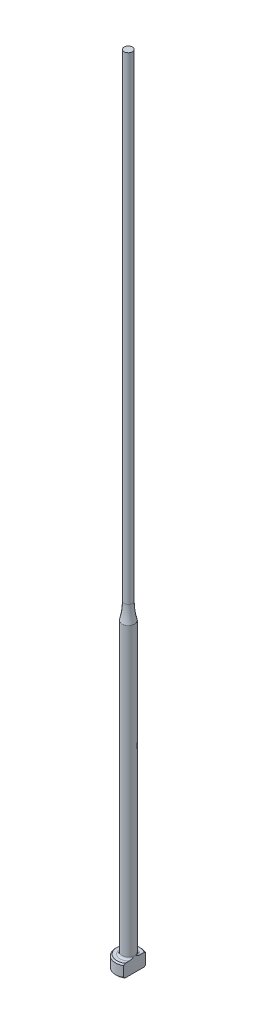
ISO-10303-21;
HEADER;
FILE_DESCRIPTION(('STEP AP214'),'2;1');
FILE_NAME('part.step','',(''),(''),'','','');
FILE_SCHEMA(('AUTOMOTIVE_DESIGN { 1 0 10303 214 1 1 1 1 }'));
ENDSEC;
DATA;
#1=APPLICATION_CONTEXT('core data for automotive mechanical design processes');
#2=APPLICATION_PROTOCOL_DEFINITION('international standard','automotive_design',2000,#1);
#3=PRODUCT_CONTEXT('',#1,'mechanical');
#4=PRODUCT('Part','Part','',(#3));
#5=PRODUCT_RELATED_PRODUCT_CATEGORY('part','',(#4));
#6=PRODUCT_DEFINITION_FORMATION('','',#4);
#7=PRODUCT_DEFINITION_CONTEXT('part definition',#1,'design');
#8=PRODUCT_DEFINITION('design','',#6,#7);
#9=PRODUCT_DEFINITION_SHAPE('','',#8);
#10=(LENGTH_UNIT() NAMED_UNIT(*) SI_UNIT(.MILLI.,.METRE.));
#11=(NAMED_UNIT(*) PLANE_ANGLE_UNIT() SI_UNIT($,.RADIAN.));
#12=(NAMED_UNIT(*) SI_UNIT($,.STERADIAN.) SOLID_ANGLE_UNIT());
#13=UNCERTAINTY_MEASURE_WITH_UNIT(LENGTH_MEASURE(1.E-05),#10,'distance_accuracy_value','');
#14=(GEOMETRIC_REPRESENTATION_CONTEXT(3) GLOBAL_UNCERTAINTY_ASSIGNED_CONTEXT((#13)) GLOBAL_UNIT_ASSIGNED_CONTEXT((#10,
#11,#12)) REPRESENTATION_CONTEXT('',''));
#15=CARTESIAN_POINT('',(0.,0.,0.));
#16=DIRECTION('',(0.,0.,1.));
#17=DIRECTION('',(1.,0.,0.));
#18=AXIS2_PLACEMENT_3D('',#15,#16,#17);
#19=CARTESIAN_POINT('',(-1.99999999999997,2.,0.));
#20=DIRECTION('',(0.,1.,0.));
#21=DIRECTION('',(0.,0.,1.));
#22=AXIS2_PLACEMENT_3D('',#19,#20,#21);
#23=PLANE('',#22);
#24=CARTESIAN_POINT('',(0.,2.,0.));
#25=DIRECTION('',(0.,1.,0.));
#26=DIRECTION('',(0.,0.,1.));
#27=AXIS2_PLACEMENT_3D('',#24,#25,#26);
#28=CIRCLE('',#27,1.79999999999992);
#29=CARTESIAN_POINT('',(0.999999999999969,2.,-1.4966629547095));
#30=VERTEX_POINT('',#29);
#31=CARTESIAN_POINT('',(0.999999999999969,2.,1.4966629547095));
#32=VERTEX_POINT('',#31);
#33=EDGE_CURVE('E187',#30,#32,#28,.T.);
#34=ORIENTED_EDGE('',*,*,#33,.T.);
#35=DIRECTION('',(0.,0.,-1.));
#36=VECTOR('',#35,1.);
#37=CARTESIAN_POINT('',(0.999999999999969,2.,0.));
#38=LINE('',#37,#36);
#39=CARTESIAN_POINT('',(0.999999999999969,2.00000000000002,0.830662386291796));
#40=VERTEX_POINT('',#39);
#41=EDGE_CURVE('E57',#32,#40,#38,.T.);
#42=ORIENTED_EDGE('',*,*,#41,.T.);
#43=CARTESIAN_POINT('',(0.,2.,0.));
#44=DIRECTION('',(0.,1.,0.));
#45=DIRECTION('',(0.,0.,1.));
#46=AXIS2_PLACEMENT_3D('',#43,#44,#45);
#47=CIRCLE('',#46,1.29999999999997);
#48=CARTESIAN_POINT('',(0.999999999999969,2.00000000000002,-0.830662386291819));
#49=VERTEX_POINT('',#48);
#50=EDGE_CURVE('E108',#40,#49,#47,.F.);
#51=ORIENTED_EDGE('',*,*,#50,.T.);
#52=EDGE_CURVE('E137',#49,#30,#38,.T.);
#53=ORIENTED_EDGE('',*,*,#52,.T.);
#54=EDGE_LOOP('',(#34,#42,#51,#53));
#55=FACE_BOUND('',#54,.T.);
#56=ADVANCED_FACE('F32',(#55),#23,.T.);
#57=CARTESIAN_POINT('',(0.,259.958771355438,0.));
#58=DIRECTION('',(0.,1.,0.));
#59=DIRECTION('',(0.,0.,1.));
#60=AXIS2_PLACEMENT_3D('',#57,#58,#59);
#61=CYLINDRICAL_SURFACE('',#60,1.99999999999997);
#62=CARTESIAN_POINT('',(0.,1.79999999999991,0.));
#63=DIRECTION('',(0.,1.,0.));
#64=DIRECTION('',(0.,0.,1.));
#65=AXIS2_PLACEMENT_3D('',#62,#63,#64);
#66=CIRCLE('',#65,1.99999999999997);
#67=CARTESIAN_POINT('',(0.999999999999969,1.79999999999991,1.73205080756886));
#68=VERTEX_POINT('',#67);
#69=CARTESIAN_POINT('',(0.999999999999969,1.79999999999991,-1.73205080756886));
#70=VERTEX_POINT('',#69);
#71=EDGE_CURVE('E105',#68,#70,#66,.F.);
#72=ORIENTED_EDGE('',*,*,#71,.T.);
#73=DIRECTION('',(0.,-1.,0.));
#74=VECTOR('',#73,1.);
#75=CARTESIAN_POINT('',(0.999999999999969,125.,-1.73205080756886));
#76=LINE('',#75,#74);
#77=CARTESIAN_POINT('',(0.999999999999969,0.199999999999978,-1.73205080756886));
#78=VERTEX_POINT('',#77);
#79=EDGE_CURVE('E193',#70,#78,#76,.T.);
#80=ORIENTED_EDGE('',*,*,#79,.T.);
#81=CARTESIAN_POINT('',(0.,0.199999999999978,0.));
#82=DIRECTION('',(0.,-1.,0.));
#83=DIRECTION('',(0.,0.,-1.));
#84=AXIS2_PLACEMENT_3D('',#81,#82,#83);
#85=CIRCLE('',#84,1.99999999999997);
#86=CARTESIAN_POINT('',(0.999999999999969,0.199999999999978,1.73205080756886));
#87=VERTEX_POINT('',#86);
#88=EDGE_CURVE('E100',#78,#87,#85,.F.);
#89=ORIENTED_EDGE('',*,*,#88,.T.);
#90=DIRECTION('',(0.,-1.,0.));
#91=VECTOR('',#90,1.);
#92=CARTESIAN_POINT('',(0.999999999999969,125.,1.73205080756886));
#93=LINE('',#92,#91);
#94=EDGE_CURVE('E93',#68,#87,#93,.T.);
#95=ORIENTED_EDGE('',*,*,#94,.F.);
#96=EDGE_LOOP('',(#72,#80,#89,#95));
#97=FACE_BOUND('',#96,.T.);
#98=ADVANCED_FACE('F158',(#97),#61,.T.);
#99=CARTESIAN_POINT('',(0.,0.,0.));
#100=DIRECTION('',(0.,-1.,0.));
#101=DIRECTION('',(0.,0.,-1.));
#102=AXIS2_PLACEMENT_3D('',#99,#100,#101);
#103=PLANE('',#102);
#104=CARTESIAN_POINT('',(0.,0.,0.));
#105=DIRECTION('',(0.,-1.,0.));
#106=DIRECTION('',(0.,0.,-1.));
#107=AXIS2_PLACEMENT_3D('',#104,#105,#106);
#108=CIRCLE('',#107,1.8);
#109=CARTESIAN_POINT('',(0.999999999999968,0.,1.49666295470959));
#110=VERTEX_POINT('',#109);
#111=CARTESIAN_POINT('',(0.999999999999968,0.,-1.49666295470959));
#112=VERTEX_POINT('',#111);
#113=EDGE_CURVE('E98',#110,#112,#108,.T.);
#114=ORIENTED_EDGE('',*,*,#113,.T.);
#115=DIRECTION('',(0.,0.,1.));
#116=VECTOR('',#115,1.);
#117=CARTESIAN_POINT('',(0.999999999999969,0.,-1.73205080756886));
#118=LINE('',#117,#116);
#119=EDGE_CURVE('E83',#112,#110,#118,.T.);
#120=ORIENTED_EDGE('',*,*,#119,.T.);
#121=EDGE_LOOP('',(#114,#120));
#122=FACE_BOUND('',#121,.T.);
#123=ADVANCED_FACE('F103',(#122),#103,.T.);
#124=CARTESIAN_POINT('',(0.,2.,0.));
#125=DIRECTION('',(0.,-1.,0.));
#126=DIRECTION('',(0.,0.,-1.));
#127=AXIS2_PLACEMENT_3D('',#124,#125,#126);
#128=CONICAL_SURFACE('',#127,1.79999999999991,0.785398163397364);
#129=ORIENTED_EDGE('',*,*,#71,.F.);
#130=CARTESIAN_POINT('',(0.999999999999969,-0.143084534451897,3.81417299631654));
#131=CARTESIAN_POINT('',(0.999999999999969,-0.0593997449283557,3.72765647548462));
#132=CARTESIAN_POINT('',(0.999999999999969,0.0241940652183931,3.64105173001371));
#133=CARTESIAN_POINT('',(0.999999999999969,0.19114891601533,3.46761616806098));
#134=CARTESIAN_POINT('',(0.999999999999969,0.27450995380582,3.38078534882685));
#135=CARTESIAN_POINT('',(0.999999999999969,0.52424932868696,3.11979400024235));
#136=CARTESIAN_POINT('',(0.999999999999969,0.690198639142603,2.94522254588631));
#137=CARTESIAN_POINT('',(0.999999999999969,1.0169755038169,2.59782670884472));
#138=CARTESIAN_POINT('',(0.999999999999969,1.1778392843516,2.42503661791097));
#139=CARTESIAN_POINT('',(0.999999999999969,1.41669118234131,2.16364984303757));
#140=CARTESIAN_POINT('',(0.999999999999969,1.49589273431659,2.07616357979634));
#141=CARTESIAN_POINT('',(0.999999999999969,1.653138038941,1.90015721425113));
#142=CARTESIAN_POINT('',(0.999999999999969,1.73118183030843,1.81163714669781));
#143=CARTESIAN_POINT('',(0.999999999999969,1.85567318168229,1.66767927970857));
#144=CARTESIAN_POINT('',(0.999999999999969,1.90265415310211,1.61270332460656));
#145=CARTESIAN_POINT('',(0.999999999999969,1.99577882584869,1.50203557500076));
#146=CARTESIAN_POINT('',(0.999999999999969,2.04192244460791,1.44634371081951));
#147=CARTESIAN_POINT('',(0.999999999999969,2.13356596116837,1.33345480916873));
#148=CARTESIAN_POINT('',(0.999999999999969,2.17905399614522,1.27624810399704));
#149=CARTESIAN_POINT('',(0.999999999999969,2.26844283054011,1.1606097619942));
#150=CARTESIAN_POINT('',(0.999999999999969,2.31234379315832,1.1021782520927));
#151=CARTESIAN_POINT('',(0.999999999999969,2.39853453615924,0.982773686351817));
#152=CARTESIAN_POINT('',(0.999999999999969,2.44078986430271,0.92177554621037));
#153=CARTESIAN_POINT('',(0.999999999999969,2.5218781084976,0.79738711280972));
#154=CARTESIAN_POINT('',(0.999999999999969,2.56070631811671,0.733993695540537));
#155=CARTESIAN_POINT('',(0.999999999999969,2.63248592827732,0.604932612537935));
#156=CARTESIAN_POINT('',(0.999999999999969,2.66550424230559,0.539302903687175));
#157=CARTESIAN_POINT('',(0.999999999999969,2.72301550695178,0.404437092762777));
#158=CARTESIAN_POINT('',(0.999999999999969,2.74753707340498,0.335214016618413));
#159=CARTESIAN_POINT('',(0.999999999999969,2.77407110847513,0.231400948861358));
#160=CARTESIAN_POINT('',(0.999999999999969,2.78110742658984,0.198093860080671));
#161=CARTESIAN_POINT('',(0.999999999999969,2.79200506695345,0.130954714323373));
#162=CARTESIAN_POINT('',(0.999999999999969,2.79586666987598,0.0971227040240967));
#163=CARTESIAN_POINT('',(0.999999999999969,2.80013905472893,0.0293410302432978));
#164=CARTESIAN_POINT('',(0.999999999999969,2.80056046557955,-0.00460794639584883));
#165=CARTESIAN_POINT('',(0.999999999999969,2.79795882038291,-0.0723663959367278));
#166=CARTESIAN_POINT('',(0.999999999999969,2.79493547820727,-0.106175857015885));
#167=CARTESIAN_POINT('',(0.999999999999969,2.78105481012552,-0.206326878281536));
#168=CARTESIAN_POINT('',(0.999999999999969,2.76542146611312,-0.272037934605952));
#169=CARTESIAN_POINT('',(0.999999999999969,2.73477554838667,-0.368312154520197));
#170=CARTESIAN_POINT('',(0.999999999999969,2.72331063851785,-0.400123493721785));
#171=CARTESIAN_POINT('',(0.999999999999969,2.69840546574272,-0.462964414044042));
#172=CARTESIAN_POINT('',(0.999999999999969,2.68496560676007,-0.493994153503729));
#173=CARTESIAN_POINT('',(0.999999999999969,2.64209309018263,-0.586298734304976));
#174=CARTESIAN_POINT('',(0.999999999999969,2.61022871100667,-0.64643570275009));
#175=CARTESIAN_POINT('',(0.999999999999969,2.54228534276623,-0.76430433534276));
#176=CARTESIAN_POINT('',(0.999999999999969,2.50620119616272,-0.822032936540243));
#177=CARTESIAN_POINT('',(0.999999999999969,2.43107084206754,-0.935840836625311));
#178=CARTESIAN_POINT('',(0.999999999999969,2.39201347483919,-0.991912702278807));
#179=CARTESIAN_POINT('',(0.999999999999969,2.31195870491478,-1.10259849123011));
#180=CARTESIAN_POINT('',(0.999999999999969,2.27096226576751,-1.15721311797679));
#181=CARTESIAN_POINT('',(0.999999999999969,2.18701695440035,-1.26606869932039));
#182=CARTESIAN_POINT('',(0.999999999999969,2.14404946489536,-1.32029522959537));
#183=CARTESIAN_POINT('',(0.999999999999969,2.05705050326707,-1.42788988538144));
#184=CARTESIAN_POINT('',(0.999999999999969,2.01301896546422,-1.48125795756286));
#185=CARTESIAN_POINT('',(0.999999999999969,1.8799506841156,-1.64010952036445));
#186=CARTESIAN_POINT('',(0.999999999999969,1.78973357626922,-1.74460261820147));
#187=CARTESIAN_POINT('',(0.999999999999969,1.62290341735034,-1.9342683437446));
#188=CARTESIAN_POINT('',(0.999999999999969,1.54658658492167,-2.01970404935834));
#189=CARTESIAN_POINT('',(0.999999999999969,1.39301250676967,-2.18973019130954));
#190=CARTESIAN_POINT('',(0.999999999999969,1.31575523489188,-2.27432060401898));
#191=CARTESIAN_POINT('',(0.999999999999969,1.08283440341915,-2.52732479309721));
#192=CARTESIAN_POINT('',(0.999999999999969,0.926165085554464,-2.69481086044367));
#193=CARTESIAN_POINT('',(0.999999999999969,0.617772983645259,-3.0214725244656));
#194=CARTESIAN_POINT('',(0.999999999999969,0.466111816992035,-3.18070657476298));
#195=CARTESIAN_POINT('',(0.999999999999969,0.238015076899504,-3.41880818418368));
#196=CARTESIAN_POINT('',(0.999999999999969,0.161924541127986,-3.49800657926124));
#197=CARTESIAN_POINT('',(0.999999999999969,0.00955322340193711,-3.65621892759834));
#198=CARTESIAN_POINT('',(0.999999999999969,-0.0667275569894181,-3.73523288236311));
#199=CARTESIAN_POINT('',(0.999999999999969,-0.143084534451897,-3.81417299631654));
#200=B_SPLINE_CURVE_WITH_KNOTS('',3,(#130,#131,#132,#133,#134,#135,#136,#137,#138,#139,#140,
#141,#142,#143,#144,#145,#146,#147,#148,#149,#150,#151,#152,#153,#154,#155,#156,#157,#158,#159,
#160,#161,#162,#163,#164,#165,#166,#167,#168,#169,#170,#171,#172,#173,#174,#175,#176,#177,#178,
#179,#180,#181,#182,#183,#184,#185,#186,#187,#188,#189,#190,#191,#192,#193,#194,#195,#196,#197,
#198,#199),.UNSPECIFIED.,.F.,.F.,(4,2,2,2,2,2,2,2,2,2,2,2,2,2,2,2,2,2,2,2,2,2,2,2,2,2,2,2,2,2,2,
2,2,2,4),(0.,0.361101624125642,0.722207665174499,1.44478731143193,2.15299784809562,
2.50702638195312,2.86104304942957,3.07798416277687,3.29494655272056,3.51418925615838,
3.73340935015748,3.95594813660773,4.17878792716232,4.3988639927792,4.6181915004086,
4.72018864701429,4.82217677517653,4.92384967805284,5.02553102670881,5.22698459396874,
5.32838854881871,5.4297717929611,5.63365200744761,5.83778406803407,6.04272417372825,
6.24756349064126,6.4551039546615,6.66265726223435,7.07676259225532,7.42043039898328,
7.76410778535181,8.45210822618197,9.11180822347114,9.44129145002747,9.77077197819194),.UNSPECIFIED.);
#201=EDGE_CURVE('E136',#68,#32,#200,.T.);
#202=ORIENTED_EDGE('',*,*,#201,.T.);
#203=ORIENTED_EDGE('',*,*,#33,.F.);
#204=EDGE_CURVE('E128',#30,#70,#200,.T.);
#205=ORIENTED_EDGE('',*,*,#204,.T.);
#206=EDGE_LOOP('',(#129,#202,#203,#205));
#207=FACE_BOUND('',#206,.T.);
#208=ADVANCED_FACE('F144',(#207),#128,.T.);
#209=CARTESIAN_POINT('',(0.,0.199999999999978,0.));
#210=DIRECTION('',(0.,1.,0.));
#211=DIRECTION('',(0.,0.,1.));
#212=AXIS2_PLACEMENT_3D('',#209,#210,#211);
#213=CONICAL_SURFACE('',#212,1.99999999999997,0.785398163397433);
#214=ORIENTED_EDGE('',*,*,#88,.F.);
#215=CARTESIAN_POINT('',(0.999999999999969,2.14308453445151,-3.81417299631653));
#216=CARTESIAN_POINT('',(0.999999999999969,2.05939974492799,-3.72765647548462));
#217=CARTESIAN_POINT('',(0.999999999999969,1.97580593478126,-3.64105173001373));
#218=CARTESIAN_POINT('',(0.999999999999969,1.80885108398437,-3.46761616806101));
#219=CARTESIAN_POINT('',(0.999999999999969,1.7254900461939,-3.38078534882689));
#220=CARTESIAN_POINT('',(0.999999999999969,1.47575067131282,-3.11979400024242));
#221=CARTESIAN_POINT('',(0.999999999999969,1.30980136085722,-2.94522254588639));
#222=CARTESIAN_POINT('',(0.999999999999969,0.983024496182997,-2.59782670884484));
#223=CARTESIAN_POINT('',(0.999999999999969,0.822160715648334,-2.42503661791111));
#224=CARTESIAN_POINT('',(0.999999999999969,0.583308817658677,-2.16364984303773));
#225=CARTESIAN_POINT('',(0.999999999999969,0.504107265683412,-2.07616357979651));
#226=CARTESIAN_POINT('',(0.999999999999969,0.34686196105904,-1.90015721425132));
#227=CARTESIAN_POINT('',(0.999999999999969,0.268818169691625,-1.81163714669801));
#228=CARTESIAN_POINT('',(0.999999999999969,0.144326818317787,-1.66767927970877));
#229=CARTESIAN_POINT('',(0.999999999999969,0.097345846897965,-1.61270332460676));
#230=CARTESIAN_POINT('',(0.999999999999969,0.00422117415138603,-1.50203557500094));
#231=CARTESIAN_POINT('',(0.999999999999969,-0.0419224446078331,-1.44634371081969));
#232=CARTESIAN_POINT('',(0.999999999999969,-0.133565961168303,-1.33345480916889));
#233=CARTESIAN_POINT('',(0.999999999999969,-0.179053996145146,-1.2762481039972));
#234=CARTESIAN_POINT('',(0.999999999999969,-0.268442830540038,-1.16060976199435));
#235=CARTESIAN_POINT('',(0.999999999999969,-0.312343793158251,-1.10217825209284));
#236=CARTESIAN_POINT('',(0.999999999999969,-0.398534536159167,-0.982773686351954));
#237=CARTESIAN_POINT('',(0.999999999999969,-0.440789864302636,-0.921775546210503));
#238=CARTESIAN_POINT('',(0.999999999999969,-0.521878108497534,-0.797387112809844));
#239=CARTESIAN_POINT('',(0.999999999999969,-0.560706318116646,-0.733993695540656));
#240=CARTESIAN_POINT('',(0.999999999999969,-0.632485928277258,-0.604932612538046));
#241=CARTESIAN_POINT('',(0.999999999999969,-0.665504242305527,-0.539302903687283));
#242=CARTESIAN_POINT('',(0.999999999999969,-0.723015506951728,-0.404437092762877));
#243=CARTESIAN_POINT('',(0.999999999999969,-0.747537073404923,-0.335214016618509));
#244=CARTESIAN_POINT('',(0.999999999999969,-0.774071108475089,-0.231400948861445));
#245=CARTESIAN_POINT('',(0.999999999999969,-0.781107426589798,-0.198093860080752));
#246=CARTESIAN_POINT('',(0.999999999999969,-0.792005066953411,-0.130954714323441));
#247=CARTESIAN_POINT('',(0.999999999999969,-0.795866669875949,-0.097122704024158));
#248=CARTESIAN_POINT('',(0.999999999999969,-0.800139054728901,-0.0293410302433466));
#249=CARTESIAN_POINT('',(0.999999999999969,-0.800560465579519,0.00460794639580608));
#250=CARTESIAN_POINT('',(0.999999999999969,-0.797958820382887,0.0723663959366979));
#251=CARTESIAN_POINT('',(0.999999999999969,-0.794935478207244,0.106175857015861));
#252=CARTESIAN_POINT('',(0.999999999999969,-0.78105481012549,0.206326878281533));
#253=CARTESIAN_POINT('',(0.999999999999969,-0.765421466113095,0.272037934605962));
#254=CARTESIAN_POINT('',(0.999999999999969,-0.734775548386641,0.368312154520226));
#255=CARTESIAN_POINT('',(0.999999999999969,-0.723310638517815,0.40012349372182));
#256=CARTESIAN_POINT('',(0.999999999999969,-0.698405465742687,0.46296441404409));
#257=CARTESIAN_POINT('',(0.999999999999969,-0.684965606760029,0.493994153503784));
#258=CARTESIAN_POINT('',(0.999999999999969,-0.642093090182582,0.586298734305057));
#259=CARTESIAN_POINT('',(0.999999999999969,-0.610228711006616,0.64643570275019));
#260=CARTESIAN_POINT('',(0.999999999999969,-0.542285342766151,0.764304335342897));
#261=CARTESIAN_POINT('',(0.999999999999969,-0.506201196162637,0.822032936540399));
#262=CARTESIAN_POINT('',(0.999999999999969,-0.431070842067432,0.935840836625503));
#263=CARTESIAN_POINT('',(0.999999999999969,-0.392013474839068,0.991912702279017));
#264=CARTESIAN_POINT('',(0.999999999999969,-0.311958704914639,1.10259849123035));
#265=CARTESIAN_POINT('',(0.999999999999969,-0.27096226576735,1.15721311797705));
#266=CARTESIAN_POINT('',(0.999999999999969,-0.187016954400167,1.26606869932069));
#267=CARTESIAN_POINT('',(0.999999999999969,-0.144049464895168,1.32029522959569));
#268=CARTESIAN_POINT('',(0.999999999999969,-0.0570505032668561,1.4278898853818));
#269=CARTESIAN_POINT('',(0.999999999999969,-0.0130189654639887,1.48125795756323));
#270=CARTESIAN_POINT('',(0.999999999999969,0.120049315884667,1.64010952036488));
#271=CARTESIAN_POINT('',(0.999999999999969,0.21026642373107,1.74460261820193));
#272=CARTESIAN_POINT('',(0.999999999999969,0.377096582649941,1.93426834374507));
#273=CARTESIAN_POINT('',(0.999999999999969,0.453413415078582,2.01970404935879));
#274=CARTESIAN_POINT('',(0.999999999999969,0.606987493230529,2.18973019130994));
#275=CARTESIAN_POINT('',(0.999999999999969,0.684244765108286,2.27432060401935));
#276=CARTESIAN_POINT('',(0.999999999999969,0.917165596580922,2.52732479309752));
#277=CARTESIAN_POINT('',(0.999999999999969,1.07383491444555,2.69481086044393));
#278=CARTESIAN_POINT('',(0.999999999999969,1.38222701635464,3.02147252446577));
#279=CARTESIAN_POINT('',(0.999999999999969,1.53388818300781,3.18070657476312));
#280=CARTESIAN_POINT('',(0.999999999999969,1.76198492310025,3.41880818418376));
#281=CARTESIAN_POINT('',(0.999999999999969,1.83807545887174,3.49800657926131));
#282=CARTESIAN_POINT('',(0.999999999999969,1.99044677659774,3.65621892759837));
#283=CARTESIAN_POINT('',(0.999999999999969,2.06672755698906,3.73523288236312));
#284=CARTESIAN_POINT('',(0.999999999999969,2.14308453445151,3.81417299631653));
#285=B_SPLINE_CURVE_WITH_KNOTS('',3,(#215,#216,#217,#218,#219,#220,#221,#222,#223,#224,#225,
#226,#227,#228,#229,#230,#231,#232,#233,#234,#235,#236,#237,#238,#239,#240,#241,#242,#243,#244,
#245,#246,#247,#248,#249,#250,#251,#252,#253,#254,#255,#256,#257,#258,#259,#260,#261,#262,#263,
#264,#265,#266,#267,#268,#269,#270,#271,#272,#273,#274,#275,#276,#277,#278,#279,#280,#281,#282,
#283,#284),.UNSPECIFIED.,.F.,.F.,(4,2,2,2,2,2,2,2,2,2,2,2,2,2,2,2,2,2,2,2,2,2,2,2,2,2,2,2,2,2,2,
2,2,2,4),(0.,0.36110162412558,0.722207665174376,1.44478731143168,2.15299784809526,
2.5070263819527,2.8610430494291,3.07798416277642,3.29494655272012,3.51418925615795,
3.73340935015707,3.95594813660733,4.17878792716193,4.39886399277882,4.61819150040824,
4.72018864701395,4.82217677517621,4.92384967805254,5.02553102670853,5.22698459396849,
5.32838854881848,5.42977179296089,5.63365200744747,5.83778406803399,6.04272417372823,
6.24756349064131,6.45510395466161,6.66265726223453,7.07676259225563,7.42043039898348,
7.7641077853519,8.45210822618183,9.1118082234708,9.44129145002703,9.77077197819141),.UNSPECIFIED.);
#286=EDGE_CURVE('E86',#78,#112,#285,.T.);
#287=ORIENTED_EDGE('',*,*,#286,.T.);
#288=ORIENTED_EDGE('',*,*,#113,.F.);
#289=EDGE_CURVE('E89',#110,#87,#285,.T.);
#290=ORIENTED_EDGE('',*,*,#289,.T.);
#291=EDGE_LOOP('',(#214,#287,#288,#290));
#292=FACE_BOUND('',#291,.T.);
#293=ADVANCED_FACE('F97',(#292),#213,.T.);
#294=CARTESIAN_POINT('',(0.,2.30000000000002,0.));
#295=DIRECTION('',(0.,1.,0.));
#296=DIRECTION('',(0.,0.,1.));
#297=AXIS2_PLACEMENT_3D('',#294,#295,#296);
#298=TOROIDAL_SURFACE('',#297,1.29999999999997,0.3);
#299=CARTESIAN_POINT('',(0.999999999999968,2.30000000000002,0.));
#300=CARTESIAN_POINT('',(0.999999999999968,2.30000064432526,8.6574445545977E-12));
#301=CARTESIAN_POINT('',(0.999999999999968,2.30000128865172,-9.05742231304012E-08));
#302=CARTESIAN_POINT('',(0.999999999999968,2.30000254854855,-3.98319620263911E-07));
#303=CARTESIAN_POINT('',(0.999999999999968,2.30000316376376,-6.16748313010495E-07));
#304=CARTESIAN_POINT('',(0.999999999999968,2.30000438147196,-1.15047367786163E-06));
#305=CARTESIAN_POINT('',(0.999999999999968,2.30000498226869,-1.46954564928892E-06));
#306=CARTESIAN_POINT('',(0.999999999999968,2.30000613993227,-2.17388585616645E-06));
#307=CARTESIAN_POINT('',(0.999999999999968,2.3000066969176,-2.55896592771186E-06));
#308=CARTESIAN_POINT('',(0.999999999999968,2.30000847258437,-3.89137454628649E-06));
#309=CARTESIAN_POINT('',(0.999999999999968,2.30000962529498,-4.9272569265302E-06));
#310=CARTESIAN_POINT('',(0.999999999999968,2.30001175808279,-7.12255376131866E-06));
#311=CARTESIAN_POINT('',(0.999999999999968,2.30001274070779,-8.27963246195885E-06));
#312=CARTESIAN_POINT('',(0.999999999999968,2.30001619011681,-1.25710396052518E-05));
#313=CARTESIAN_POINT('',(0.999999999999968,2.30001847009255,-1.58589994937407E-05));
#314=CARTESIAN_POINT('',(0.999999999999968,2.3000224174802,-2.25210462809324E-05));
#315=CARTESIAN_POINT('',(0.999999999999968,2.30002411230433,-2.58796667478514E-05));
#316=CARTESIAN_POINT('',(0.999999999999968,2.30003085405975,-3.94941957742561E-05));
#317=CARTESIAN_POINT('',(0.999999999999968,2.30003568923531,-4.98493079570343E-05));
#318=CARTESIAN_POINT('',(0.999999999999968,2.30004388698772,-6.96407730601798E-05));
#319=CARTESIAN_POINT('',(0.999999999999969,2.30004735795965,-7.903098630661E-05));
#320=CARTESIAN_POINT('',(0.999999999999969,2.30007348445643,-0.000144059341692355));
#321=CARTESIAN_POINT('',(0.999999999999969,2.30010510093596,-0.000195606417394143));
#322=CARTESIAN_POINT('',(0.999999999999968,2.30022061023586,-0.000391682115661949));
#323=CARTESIAN_POINT('',(0.999999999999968,2.3002978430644,-0.000539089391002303));
#324=CARTESIAN_POINT('',(0.999999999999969,2.30059433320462,-0.00109591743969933));
#325=CARTESIAN_POINT('',(0.999999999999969,2.30082052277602,-0.00150237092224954));
#326=CARTESIAN_POINT('',(0.999999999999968,2.30171558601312,-0.00311941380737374));
#327=CARTESIAN_POINT('',(0.999999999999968,2.30237677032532,-0.00433326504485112));
#328=CARTESIAN_POINT('',(0.999999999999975,2.31602135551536,-0.0293725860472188));
#329=CARTESIAN_POINT('',(0.99999999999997,2.32909104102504,-0.0531623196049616));
#330=CARTESIAN_POINT('',(0.999999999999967,2.35458080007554,-0.100088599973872));
#331=CARTESIAN_POINT('',(0.999999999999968,2.36700820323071,-0.123221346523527));
#332=CARTESIAN_POINT('',(0.999999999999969,2.39281545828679,-0.172044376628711));
#333=CARTESIAN_POINT('',(0.999999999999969,2.4061616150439,-0.197752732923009));
#334=CARTESIAN_POINT('',(0.999999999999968,2.4323541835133,-0.249714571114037));
#335=CARTESIAN_POINT('',(0.999999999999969,2.44519503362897,-0.27597087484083));
#336=CARTESIAN_POINT('',(0.999999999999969,2.46718175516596,-0.322864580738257));
#337=CARTESIAN_POINT('',(0.999999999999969,2.47650292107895,-0.34341923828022));
#338=CARTESIAN_POINT('',(0.999999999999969,2.49448113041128,-0.384761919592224));
#339=CARTESIAN_POINT('',(0.999999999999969,2.50313958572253,-0.405549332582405));
#340=CARTESIAN_POINT('',(0.999999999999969,2.5276434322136,-0.467585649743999));
#341=CARTESIAN_POINT('',(0.999999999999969,2.54239224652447,-0.509286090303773));
#342=CARTESIAN_POINT('',(0.999999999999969,2.56458900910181,-0.58349816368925));
#343=CARTESIAN_POINT('',(0.999999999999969,2.57294045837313,-0.61573699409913));
#344=CARTESIAN_POINT('',(0.999999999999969,2.58691787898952,-0.682155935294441));
#345=CARTESIAN_POINT('',(0.999999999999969,2.5924232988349,-0.716362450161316));
#346=CARTESIAN_POINT('',(0.999999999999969,2.59932200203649,-0.784996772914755));
#347=CARTESIAN_POINT('',(0.999999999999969,2.60074119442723,-0.819421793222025));
#348=CARTESIAN_POINT('',(0.999999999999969,2.59853032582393,-0.88779225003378));
#349=CARTESIAN_POINT('',(0.999999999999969,2.59495737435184,-0.921738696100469));
#350=CARTESIAN_POINT('',(0.999999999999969,2.58381038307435,-0.977927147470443));
#351=CARTESIAN_POINT('',(0.999999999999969,2.57785171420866,-1.00048693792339));
#352=CARTESIAN_POINT('',(0.999999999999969,2.56267132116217,-1.0445512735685));
#353=CARTESIAN_POINT('',(0.999999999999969,2.55344592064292,-1.06605459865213));
#354=CARTESIAN_POINT('',(0.999999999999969,2.53348156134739,-1.10327564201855));
#355=CARTESIAN_POINT('',(0.999999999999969,2.52335553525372,-1.11931996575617));
#356=CARTESIAN_POINT('',(0.999999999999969,2.50063930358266,-1.1495565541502));
#357=CARTESIAN_POINT('',(0.999999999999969,2.48805327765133,-1.16375189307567));
#358=CARTESIAN_POINT('',(0.999999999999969,2.46313284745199,-1.18709127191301));
#359=CARTESIAN_POINT('',(0.999999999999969,2.45121755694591,-1.19668155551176));
#360=CARTESIAN_POINT('',(0.999999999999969,2.4259612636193,-1.21377371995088));
#361=CARTESIAN_POINT('',(0.999999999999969,2.41262072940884,-1.2212762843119));
#362=CARTESIAN_POINT('',(0.999999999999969,2.38471163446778,-1.23381879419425));
#363=CARTESIAN_POINT('',(0.999999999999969,2.3701356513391,-1.23884240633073));
#364=CARTESIAN_POINT('',(0.999999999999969,2.34029120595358,-1.2460136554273));
#365=CARTESIAN_POINT('',(0.999999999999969,2.32502317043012,-1.24816304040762));
#366=CARTESIAN_POINT('',(0.999999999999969,2.29609418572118,-1.24936303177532));
#367=CARTESIAN_POINT('',(0.999999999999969,2.28244572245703,-1.24873511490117));
#368=CARTESIAN_POINT('',(0.999999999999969,2.25546467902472,-1.24513625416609));
#369=CARTESIAN_POINT('',(0.999999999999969,2.2421320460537,-1.24216570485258));
#370=CARTESIAN_POINT('',(0.999999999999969,2.21644742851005,-1.23414136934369));
#371=CARTESIAN_POINT('',(0.999999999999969,2.20408009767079,-1.22913614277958));
#372=CARTESIAN_POINT('',(0.999999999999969,2.18026539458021,-1.2172891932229));
#373=CARTESIAN_POINT('',(0.999999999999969,2.16881815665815,-1.21044720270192));
#374=CARTESIAN_POINT('',(0.999999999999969,2.14602713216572,-1.19450929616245));
#375=CARTESIAN_POINT('',(0.999999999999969,2.1347876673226,-1.18526487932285));
#376=CARTESIAN_POINT('',(0.999999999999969,2.11372805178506,-1.16528066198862));
#377=CARTESIAN_POINT('',(0.999999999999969,2.1039092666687,-1.15453944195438));
#378=CARTESIAN_POINT('',(0.999999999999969,2.08131380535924,-1.12639326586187));
#379=CARTESIAN_POINT('',(0.999999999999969,2.06941227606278,-1.10828305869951));
#380=CARTESIAN_POINT('',(0.999999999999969,2.04871157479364,-1.07041295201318));
#381=CARTESIAN_POINT('',(0.999999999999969,2.03991325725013,-1.05065259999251));
#382=CARTESIAN_POINT('',(0.999999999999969,2.02219264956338,-1.00203188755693));
#383=CARTESIAN_POINT('',(0.999999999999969,2.01461756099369,-0.972682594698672));
#384=CARTESIAN_POINT('',(0.999999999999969,2.00410660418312,-0.912914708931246));
#385=CARTESIAN_POINT('',(0.999999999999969,2.00122174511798,-0.882487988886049));
#386=CARTESIAN_POINT('',(0.999999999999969,1.99886242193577,-0.80318909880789));
#387=CARTESIAN_POINT('',(0.999999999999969,2.0024814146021,-0.754226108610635));
#388=CARTESIAN_POINT('',(0.999999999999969,2.01327071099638,-0.682724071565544));
#389=CARTESIAN_POINT('',(0.999999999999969,2.01762186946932,-0.659663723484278));
#390=CARTESIAN_POINT('',(0.999999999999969,2.02775671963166,-0.613959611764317));
#391=CARTESIAN_POINT('',(0.999999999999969,2.03353398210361,-0.59131445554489));
#392=CARTESIAN_POINT('',(0.999999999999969,2.05232003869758,-0.525222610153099));
#393=CARTESIAN_POINT('',(0.999999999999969,2.0670175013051,-0.482256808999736));
#394=CARTESIAN_POINT('',(0.999999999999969,2.09166172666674,-0.418361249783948));
#395=CARTESIAN_POINT('',(0.999999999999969,2.10040936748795,-0.396945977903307));
#396=CARTESIAN_POINT('',(0.999999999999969,2.11862724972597,-0.354367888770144));
#397=CARTESIAN_POINT('',(0.999999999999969,2.12809902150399,-0.33320572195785));
#398=CARTESIAN_POINT('',(0.999999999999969,2.15054796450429,-0.284809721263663));
#399=CARTESIAN_POINT('',(0.999999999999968,2.16372144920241,-0.257667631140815));
#400=CARTESIAN_POINT('',(0.999999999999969,2.19063957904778,-0.203972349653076));
#401=CARTESIAN_POINT('',(0.999999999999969,2.20437810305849,-0.177416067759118));
#402=CARTESIAN_POINT('',(0.999999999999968,2.23096755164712,-0.127000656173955));
#403=CARTESIAN_POINT('',(0.999999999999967,2.2437812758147,-0.103121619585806));
#404=CARTESIAN_POINT('',(0.99999999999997,2.27007504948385,-0.0546869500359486));
#405=CARTESIAN_POINT('',(0.999999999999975,2.28356304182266,-0.0301354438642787));
#406=CARTESIAN_POINT('',(0.999999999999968,2.29762327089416,-0.00433318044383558));
#407=CARTESIAN_POINT('',(0.999999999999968,2.29828450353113,-0.00311924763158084));
#408=CARTESIAN_POINT('',(0.999999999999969,2.29917957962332,-0.0015021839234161));
#409=CARTESIAN_POINT('',(0.999999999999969,2.2994057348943,-0.0010957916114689));
#410=CARTESIAN_POINT('',(0.999999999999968,2.29970218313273,-0.000539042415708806));
#411=CARTESIAN_POINT('',(0.999999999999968,2.29977940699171,-0.000391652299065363));
#412=CARTESIAN_POINT('',(0.999999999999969,2.29989490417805,-0.000195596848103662));
#413=CARTESIAN_POINT('',(0.999999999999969,2.2999265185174,-0.000144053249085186));
#414=CARTESIAN_POINT('',(0.999999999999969,2.29995264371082,-7.90290824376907E-05));
#415=CARTESIAN_POINT('',(0.999999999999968,2.29995611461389,-6.96391975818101E-05));
#416=CARTESIAN_POINT('',(0.999999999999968,2.29996431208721,-4.98484228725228E-05));
#417=CARTESIAN_POINT('',(0.999999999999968,2.29996914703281,-3.94936645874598E-05));
#418=CARTESIAN_POINT('',(0.999999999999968,2.29997588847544,-2.587953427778E-05));
#419=CARTESIAN_POINT('',(0.999999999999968,2.29997758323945,-2.25209724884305E-05));
#420=CARTESIAN_POINT('',(0.999999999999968,2.29998153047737,-1.58590310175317E-05));
#421=CARTESIAN_POINT('',(0.999999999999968,2.29998381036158,-1.25711163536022E-05));
#422=CARTESIAN_POINT('',(0.999999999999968,2.29998725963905,-8.27974911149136E-06));
#423=CARTESIAN_POINT('',(0.999999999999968,2.29998824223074,-7.122675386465E-06));
#424=CARTESIAN_POINT('',(0.999999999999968,2.29999037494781,-4.92738159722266E-06));
#425=CARTESIAN_POINT('',(0.999999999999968,2.29999152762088,-3.89149712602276E-06));
#426=CARTESIAN_POINT('',(0.999999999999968,2.29999330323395,-2.5590774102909E-06));
#427=CARTESIAN_POINT('',(0.999999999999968,2.29999386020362,-2.17399250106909E-06));
#428=CARTESIAN_POINT('',(0.999999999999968,2.29999501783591,-1.4696398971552E-06));
#429=CARTESIAN_POINT('',(0.999999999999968,2.299995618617,-1.15056035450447E-06));
#430=CARTESIAN_POINT('',(0.999999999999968,2.29999683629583,-6.16816558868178E-07));
#431=CARTESIAN_POINT('',(0.999999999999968,2.29999745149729,-3.98377208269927E-07));
#432=CARTESIAN_POINT('',(0.999999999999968,2.29999871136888,-9.06063088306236E-08));
#433=CARTESIAN_POINT('',(0.999999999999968,2.29999935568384,-8.657323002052E-12));
#434=CARTESIAN_POINT('',(0.999999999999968,2.30000000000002,0.));
#435=B_SPLINE_CURVE_WITH_KNOTS('',3,(#299,#300,#301,#302,#303,#304,#305,#306,#307,#308,#309,
#310,#311,#312,#313,#314,#315,#316,#317,#318,#319,#320,#321,#322,#323,#324,#325,#326,#327,#328,
#329,#330,#331,#332,#333,#334,#335,#336,#337,#338,#339,#340,#341,#342,#343,#344,#345,#346,#347,
#348,#349,#350,#351,#352,#353,#354,#355,#356,#357,#358,#359,#360,#361,#362,#363,#364,#365,#366,
#367,#368,#369,#370,#371,#372,#373,#374,#375,#376,#377,#378,#379,#380,#381,#382,#383,#384,#385,
#386,#387,#388,#389,#390,#391,#392,#393,#394,#395,#396,#397,#398,#399,#400,#401,#402,#403,#404,
#405,#406,#407,#408,#409,#410,#411,#412,#413,#414,#415,#416,#417,#418,#419,#420,#421,#422,#423,
#424,#425,#426,#427,#428,#429,#430,#431,#432,#433,#434),.UNSPECIFIED.,.T.,.F.,(4,2,2,2,2,2,2,2,
2,2,2,2,2,2,2,2,2,2,2,2,2,2,2,2,2,2,2,2,2,2,2,2,2,2,2,2,2,2,2,2,2,2,2,2,2,2,2,2,2,2,2,2,2,2,2,2,
2,2,2,2,2,2,2,2,2,2,2,4),(0.,1.93088000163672E-06,3.88121487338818E-06,5.91576027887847E-06,
7.94459959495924E-06,1.25713540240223E-05,1.71213138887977E-05,2.9075120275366E-05,
4.0350817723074E-05,7.46190414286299E-05,0.000104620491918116,0.00028499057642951,
0.000785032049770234,0.00217951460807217,0.00632720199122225,0.0877445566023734,
0.166524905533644,0.253417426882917,0.341089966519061,0.408787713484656,0.476336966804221,
0.608850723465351,0.708652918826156,0.812393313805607,0.915474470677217,1.01738599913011,
1.08718721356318,1.15706723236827,1.21377727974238,1.27039179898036,1.31609373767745,
1.36178069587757,1.40776478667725,1.4537208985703,1.49450576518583,1.5352837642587,
1.57514089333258,1.61500383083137,1.65849635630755,1.70203041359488,1.76667915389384,
1.83134568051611,1.92177629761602,2.0131839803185,2.15955153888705,2.22993031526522,
2.29999742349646,2.43600819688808,2.50540041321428,2.57494356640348,2.66544006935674,
2.75513178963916,2.83643278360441,2.92045687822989,2.92460484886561,2.92599912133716,
2.926499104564,2.92667946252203,2.92670946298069,2.92674372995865,2.92675500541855,
2.92676695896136,2.92677150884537,2.92677613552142,2.92677816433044,2.92678019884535,
2.92678214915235,2.92678408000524),.UNSPECIFIED.);
#436=CARTESIAN_POINT('',(0.999999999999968,2.30000000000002,0.));
#437=VERTEX_POINT('',#436);
#438=EDGE_CURVE('E11',#49,#437,#435,.T.);
#439=ORIENTED_EDGE('',*,*,#438,.F.);
#440=ORIENTED_EDGE('',*,*,#50,.F.);
#441=CARTESIAN_POINT('',(0.999999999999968,2.30000000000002,0.));
#442=CARTESIAN_POINT('',(0.999999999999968,2.29999935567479,-8.65741696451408E-12));
#443=CARTESIAN_POINT('',(0.999999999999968,2.29999871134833,9.05742231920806E-08));
#444=CARTESIAN_POINT('',(0.999999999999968,2.2999974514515,3.98319620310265E-07));
#445=CARTESIAN_POINT('',(0.999999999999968,2.29999683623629,6.16748313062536E-07));
#446=CARTESIAN_POINT('',(0.999999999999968,2.29999561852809,1.15047367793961E-06));
#447=CARTESIAN_POINT('',(0.999999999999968,2.29999501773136,1.46954564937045E-06));
#448=CARTESIAN_POINT('',(0.999999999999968,2.29999386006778,2.17388585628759E-06));
#449=CARTESIAN_POINT('',(0.999999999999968,2.29999330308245,2.55896592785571E-06));
#450=CARTESIAN_POINT('',(0.999999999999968,2.29999152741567,3.89137454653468E-06));
#451=CARTESIAN_POINT('',(0.999999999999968,2.29999037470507,4.92725692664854E-06));
#452=CARTESIAN_POINT('',(0.999999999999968,2.29998824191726,7.12255376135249E-06));
#453=CARTESIAN_POINT('',(0.999999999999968,2.29998725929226,8.27963246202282E-06));
#454=CARTESIAN_POINT('',(0.999999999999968,2.29998380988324,1.25710396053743E-05));
#455=CARTESIAN_POINT('',(0.999999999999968,2.2999815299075,1.58589994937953E-05));
#456=CARTESIAN_POINT('',(0.999999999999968,2.29997758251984,2.25210462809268E-05));
#457=CARTESIAN_POINT('',(0.999999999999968,2.29997588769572,2.58796667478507E-05));
#458=CARTESIAN_POINT('',(0.999999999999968,2.29996914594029,3.94941957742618E-05));
#459=CARTESIAN_POINT('',(0.999999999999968,2.29996431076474,4.98493079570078E-05));
#460=CARTESIAN_POINT('',(0.999999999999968,2.29995611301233,6.96407730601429E-05));
#461=CARTESIAN_POINT('',(0.999999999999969,2.2999526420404,7.90309863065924E-05));
#462=CARTESIAN_POINT('',(0.999999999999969,2.29992651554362,0.000144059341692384));
#463=CARTESIAN_POINT('',(0.999999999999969,2.29989489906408,0.000195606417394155));
#464=CARTESIAN_POINT('',(0.999999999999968,2.29977938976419,0.000391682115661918));
#465=CARTESIAN_POINT('',(0.999999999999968,2.29970215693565,0.000539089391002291));
#466=CARTESIAN_POINT('',(0.999999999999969,2.29940566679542,0.00109591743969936));
#467=CARTESIAN_POINT('',(0.999999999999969,2.29917947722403,0.00150237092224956));
#468=CARTESIAN_POINT('',(0.999999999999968,2.29828441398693,0.0031194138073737));
#469=CARTESIAN_POINT('',(0.999999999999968,2.29762322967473,0.0043332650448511));
#470=CARTESIAN_POINT('',(0.999999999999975,2.28397864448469,0.0293725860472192));
#471=CARTESIAN_POINT('',(0.99999999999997,2.27090895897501,0.0531623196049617));
#472=CARTESIAN_POINT('',(0.999999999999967,2.24541919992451,0.100088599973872));
#473=CARTESIAN_POINT('',(0.999999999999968,2.23299179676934,0.123221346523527));
#474=CARTESIAN_POINT('',(0.999999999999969,2.20718454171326,0.172044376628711));
#475=CARTESIAN_POINT('',(0.999999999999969,2.19383838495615,0.197752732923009));
#476=CARTESIAN_POINT('',(0.999999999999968,2.16764581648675,0.249714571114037));
#477=CARTESIAN_POINT('',(0.999999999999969,2.15480496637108,0.27597087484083));
#478=CARTESIAN_POINT('',(0.999999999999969,2.13281824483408,0.322864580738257));
#479=CARTESIAN_POINT('',(0.999999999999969,2.1234970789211,0.34341923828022));
#480=CARTESIAN_POINT('',(0.999999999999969,2.10551886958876,0.384761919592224));
#481=CARTESIAN_POINT('',(0.999999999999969,2.09686041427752,0.405549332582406));
#482=CARTESIAN_POINT('',(0.999999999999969,2.07235656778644,0.467585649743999));
#483=CARTESIAN_POINT('',(0.999999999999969,2.05760775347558,0.509286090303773));
#484=CARTESIAN_POINT('',(0.999999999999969,2.03541099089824,0.58349816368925));
#485=CARTESIAN_POINT('',(0.999999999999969,2.02705954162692,0.61573699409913));
#486=CARTESIAN_POINT('',(0.999999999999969,2.01308212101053,0.682155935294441));
#487=CARTESIAN_POINT('',(0.999999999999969,2.00757670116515,0.716362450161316));
#488=CARTESIAN_POINT('',(0.999999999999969,2.00067799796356,0.784996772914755));
#489=CARTESIAN_POINT('',(0.999999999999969,1.99925880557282,0.819421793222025));
#490=CARTESIAN_POINT('',(0.999999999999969,2.00146967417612,0.88779225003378));
#491=CARTESIAN_POINT('',(0.999999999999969,2.00504262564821,0.921738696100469));
#492=CARTESIAN_POINT('',(0.999999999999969,2.0161896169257,0.977927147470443));
#493=CARTESIAN_POINT('',(0.999999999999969,2.02214828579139,1.00048693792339));
#494=CARTESIAN_POINT('',(0.999999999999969,2.03732867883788,1.0445512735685));
#495=CARTESIAN_POINT('',(0.999999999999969,2.04655407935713,1.06605459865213));
#496=CARTESIAN_POINT('',(0.999999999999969,2.06651843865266,1.10327564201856));
#497=CARTESIAN_POINT('',(0.999999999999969,2.07664446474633,1.11931996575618));
#498=CARTESIAN_POINT('',(0.999999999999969,2.09936069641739,1.14955655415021));
#499=CARTESIAN_POINT('',(0.999999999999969,2.11194672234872,1.16375189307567));
#500=CARTESIAN_POINT('',(0.999999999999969,2.13686715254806,1.18709127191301));
#501=CARTESIAN_POINT('',(0.999999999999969,2.14878244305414,1.19668155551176));
#502=CARTESIAN_POINT('',(0.999999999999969,2.17403873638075,1.21377371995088));
#503=CARTESIAN_POINT('',(0.999999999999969,2.18737927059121,1.2212762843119));
#504=CARTESIAN_POINT('',(0.999999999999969,2.21528836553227,1.23381879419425));
#505=CARTESIAN_POINT('',(0.999999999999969,2.22986434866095,1.23884240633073));
#506=CARTESIAN_POINT('',(0.999999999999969,2.25970879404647,1.2460136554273));
#507=CARTESIAN_POINT('',(0.999999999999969,2.27497682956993,1.24816304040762));
#508=CARTESIAN_POINT('',(0.999999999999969,2.30390581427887,1.24936303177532));
#509=CARTESIAN_POINT('',(0.999999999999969,2.31755427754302,1.24873511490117));
#510=CARTESIAN_POINT('',(0.999999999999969,2.34453532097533,1.24513625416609));
#511=CARTESIAN_POINT('',(0.999999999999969,2.35786795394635,1.24216570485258));
#512=CARTESIAN_POINT('',(0.999999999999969,2.38355257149,1.23414136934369));
#513=CARTESIAN_POINT('',(0.999999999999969,2.39591990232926,1.22913614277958));
#514=CARTESIAN_POINT('',(0.999999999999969,2.41973460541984,1.2172891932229));
#515=CARTESIAN_POINT('',(0.999999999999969,2.4311818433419,1.21044720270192));
#516=CARTESIAN_POINT('',(0.999999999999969,2.45397286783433,1.19450929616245));
#517=CARTESIAN_POINT('',(0.999999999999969,2.46521233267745,1.18526487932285));
#518=CARTESIAN_POINT('',(0.999999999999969,2.48627194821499,1.16528066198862));
#519=CARTESIAN_POINT('',(0.999999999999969,2.49609073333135,1.15453944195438));
#520=CARTESIAN_POINT('',(0.999999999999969,2.51868619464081,1.12639326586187));
#521=CARTESIAN_POINT('',(0.999999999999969,2.53058772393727,1.10828305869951));
#522=CARTESIAN_POINT('',(0.999999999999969,2.55128842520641,1.07041295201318));
#523=CARTESIAN_POINT('',(0.999999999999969,2.56008674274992,1.05065259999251));
#524=CARTESIAN_POINT('',(0.999999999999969,2.57780735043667,1.00203188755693));
#525=CARTESIAN_POINT('',(0.999999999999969,2.58538243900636,0.972682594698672));
#526=CARTESIAN_POINT('',(0.999999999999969,2.59589339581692,0.912914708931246));
#527=CARTESIAN_POINT('',(0.999999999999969,2.59877825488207,0.882487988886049));
#528=CARTESIAN_POINT('',(0.999999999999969,2.60113757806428,0.80318909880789));
#529=CARTESIAN_POINT('',(0.999999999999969,2.59751858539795,0.754226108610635));
#530=CARTESIAN_POINT('',(0.999999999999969,2.58672928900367,0.682724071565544));
#531=CARTESIAN_POINT('',(0.999999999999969,2.58237813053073,0.659663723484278));
#532=CARTESIAN_POINT('',(0.999999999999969,2.57224328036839,0.613959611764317));
#533=CARTESIAN_POINT('',(0.999999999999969,2.56646601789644,0.59131445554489));
#534=CARTESIAN_POINT('',(0.999999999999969,2.54767996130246,0.525222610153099));
#535=CARTESIAN_POINT('',(0.999999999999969,2.53298249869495,0.482256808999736));
#536=CARTESIAN_POINT('',(0.999999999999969,2.50833827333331,0.418361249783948));
#537=CARTESIAN_POINT('',(0.999999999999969,2.49959063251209,0.396945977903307));
#538=CARTESIAN_POINT('',(0.999999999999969,2.48137275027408,0.354367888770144));
#539=CARTESIAN_POINT('',(0.999999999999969,2.47190097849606,0.33320572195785));
#540=CARTESIAN_POINT('',(0.999999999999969,2.44945203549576,0.284809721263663));
#541=CARTESIAN_POINT('',(0.999999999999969,2.43627855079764,0.257667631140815));
#542=CARTESIAN_POINT('',(0.999999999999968,2.40936042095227,0.203972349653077));
#543=CARTESIAN_POINT('',(0.999999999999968,2.39562189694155,0.177416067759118));
#544=CARTESIAN_POINT('',(0.999999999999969,2.36903244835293,0.127000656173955));
#545=CARTESIAN_POINT('',(0.999999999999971,2.35621872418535,0.103121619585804));
#546=CARTESIAN_POINT('',(0.999999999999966,2.32992495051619,0.0546869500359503));
#547=CARTESIAN_POINT('',(0.999999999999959,2.31643695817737,0.0301354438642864));
#548=CARTESIAN_POINT('',(0.999999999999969,2.30237672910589,0.0043331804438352));
#549=CARTESIAN_POINT('',(0.99999999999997,2.30171549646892,0.00311924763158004));
#550=CARTESIAN_POINT('',(0.999999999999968,2.30082042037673,0.00150218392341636));
#551=CARTESIAN_POINT('',(0.999999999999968,2.30059426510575,0.00109579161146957));
#552=CARTESIAN_POINT('',(0.999999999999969,2.30029781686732,0.000539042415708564));
#553=CARTESIAN_POINT('',(0.999999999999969,2.30022059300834,0.000391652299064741));
#554=CARTESIAN_POINT('',(0.999999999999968,2.300105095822,0.000195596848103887));
#555=CARTESIAN_POINT('',(0.999999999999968,2.30007348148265,0.000144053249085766));
#556=CARTESIAN_POINT('',(0.999999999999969,2.30004735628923,7.90290824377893E-05));
#557=CARTESIAN_POINT('',(0.999999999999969,2.30004388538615,6.96391975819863E-05));
#558=CARTESIAN_POINT('',(0.999999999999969,2.30003568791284,4.98484228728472E-05));
#559=CARTESIAN_POINT('',(0.999999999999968,2.30003085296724,3.9493664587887E-05));
#560=CARTESIAN_POINT('',(0.999999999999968,2.30002411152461,2.5879534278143E-05));
#561=CARTESIAN_POINT('',(0.999999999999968,2.3000224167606,2.25209724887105E-05));
#562=CARTESIAN_POINT('',(0.999999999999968,2.30001846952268,1.58590310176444E-05));
#563=CARTESIAN_POINT('',(0.999999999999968,2.30001618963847,1.25711163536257E-05));
#564=CARTESIAN_POINT('',(0.999999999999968,2.300012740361,8.27974911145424E-06));
#565=CARTESIAN_POINT('',(0.999999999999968,2.30001175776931,7.12267538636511E-06));
#566=CARTESIAN_POINT('',(0.999999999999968,2.30000962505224,4.92738159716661E-06));
#567=CARTESIAN_POINT('',(0.999999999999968,2.30000847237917,3.89149712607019E-06));
#568=CARTESIAN_POINT('',(0.999999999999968,2.3000066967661,2.55907741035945E-06));
#569=CARTESIAN_POINT('',(0.999999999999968,2.30000613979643,2.17399250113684E-06));
#570=CARTESIAN_POINT('',(0.999999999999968,2.30000498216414,1.46963989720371E-06));
#571=CARTESIAN_POINT('',(0.999999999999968,2.30000438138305,1.15056035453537E-06));
#572=CARTESIAN_POINT('',(0.999999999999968,2.30000316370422,6.16816558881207E-07));
#573=CARTESIAN_POINT('',(0.999999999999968,2.30000254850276,3.98377208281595E-07));
#574=CARTESIAN_POINT('',(0.999999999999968,2.30000128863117,9.06063088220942E-08));
#575=CARTESIAN_POINT('',(0.999999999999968,2.30000064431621,8.65729541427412E-12));
#576=CARTESIAN_POINT('',(0.999999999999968,2.30000000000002,0.));
#577=B_SPLINE_CURVE_WITH_KNOTS('',3,(#441,#442,#443,#444,#445,#446,#447,#448,#449,#450,#451,
#452,#453,#454,#455,#456,#457,#458,#459,#460,#461,#462,#463,#464,#465,#466,#467,#468,#469,#470,
#471,#472,#473,#474,#475,#476,#477,#478,#479,#480,#481,#482,#483,#484,#485,#486,#487,#488,#489,
#490,#491,#492,#493,#494,#495,#496,#497,#498,#499,#500,#501,#502,#503,#504,#505,#506,#507,#508,
#509,#510,#511,#512,#513,#514,#515,#516,#517,#518,#519,#520,#521,#522,#523,#524,#525,#526,#527,
#528,#529,#530,#531,#532,#533,#534,#535,#536,#537,#538,#539,#540,#541,#542,#543,#544,#545,#546,
#547,#548,#549,#550,#551,#552,#553,#554,#555,#556,#557,#558,#559,#560,#561,#562,#563,#564,#565,
#566,#567,#568,#569,#570,#571,#572,#573,#574,#575,#576),.UNSPECIFIED.,.T.,.F.,(4,2,2,2,2,2,2,2,
2,2,2,2,2,2,2,2,2,2,2,2,2,2,2,2,2,2,2,2,2,2,2,2,2,2,2,2,2,2,2,2,2,2,2,2,2,2,2,2,2,2,2,2,2,2,2,2,
2,2,2,2,2,2,2,2,2,2,2,4),(0.,1.93088000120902E-06,3.88121487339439E-06,5.91576027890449E-06,
7.94459959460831E-06,1.2571354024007E-05,1.71213138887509E-05,2.90751202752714E-05,
4.03508177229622E-05,7.46190414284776E-05,0.000104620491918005,0.000284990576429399,
0.000785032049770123,0.00217951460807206,0.00632720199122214,0.0877445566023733,
0.166524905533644,0.253417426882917,0.341089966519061,0.408787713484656,0.476336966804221,
0.608850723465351,0.708652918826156,0.812393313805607,0.915474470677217,1.01738599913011,
1.08718721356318,1.15706723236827,1.21377727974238,1.27039179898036,1.31609373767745,
1.36178069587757,1.40776478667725,1.4537208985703,1.49450576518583,1.5352837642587,
1.57514089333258,1.61500383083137,1.65849635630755,1.70203041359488,1.76667915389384,
1.83134568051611,1.92177629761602,2.0131839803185,2.15955153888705,2.22993031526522,
2.29999742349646,2.43600819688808,2.50540041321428,2.57494356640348,2.66544006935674,
2.75513178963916,2.83643278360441,2.92045687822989,2.92460484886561,2.92599912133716,
2.926499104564,2.92667946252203,2.92670946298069,2.92674372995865,2.92675500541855,
2.92676695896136,2.92677150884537,2.92677613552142,2.92677816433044,2.92678019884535,
2.92678214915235,2.92678408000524),.UNSPECIFIED.);
#578=EDGE_CURVE('E46',#437,#40,#577,.T.);
#579=ORIENTED_EDGE('',*,*,#578,.F.);
#580=CARTESIAN_POINT('',(0.,2.30000000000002,0.));
#581=DIRECTION('',(0.,1.,0.));
#582=DIRECTION('',(0.,0.,1.));
#583=AXIS2_PLACEMENT_3D('',#580,#581,#582);
#584=CIRCLE('',#583,0.999999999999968);
#585=EDGE_CURVE('E104',#437,#437,#584,.T.);
#586=ORIENTED_EDGE('',*,*,#585,.F.);
#587=EDGE_LOOP('',(#439,#440,#579,#586));
#588=FACE_BOUND('',#587,.T.);
#589=ADVANCED_FACE('F34',(#588),#298,.F.);
#590=CARTESIAN_POINT('',(-0.649999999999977,125.,0.));
#591=DIRECTION('',(0.,1.,0.));
#592=DIRECTION('',(0.,0.,1.));
#593=AXIS2_PLACEMENT_3D('',#590,#591,#592);
#594=PLANE('',#593);
#595=CARTESIAN_POINT('',(0.,125.,0.));
#596=DIRECTION('',(0.,1.,0.));
#597=DIRECTION('',(0.,0.,1.));
#598=AXIS2_PLACEMENT_3D('',#595,#596,#597);
#599=CIRCLE('',#598,0.649999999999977);
#600=CARTESIAN_POINT('',(0.,125.,0.649999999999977));
#601=VERTEX_POINT('',#600);
#602=EDGE_CURVE('E186',#601,#601,#599,.T.);
#603=ORIENTED_EDGE('',*,*,#602,.T.);
#604=EDGE_LOOP('',(#603));
#605=FACE_BOUND('',#604,.T.);
#606=ADVANCED_FACE('F149',(#605),#594,.T.);
#607=CARTESIAN_POINT('',(0.,259.958771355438,0.));
#608=DIRECTION('',(0.,1.,0.));
#609=DIRECTION('',(0.,0.,1.));
#610=AXIS2_PLACEMENT_3D('',#607,#608,#609);
#611=CYLINDRICAL_SURFACE('',#610,0.649999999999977);
#612=CARTESIAN_POINT('',(0.,50.,0.));
#613=DIRECTION('',(0.,1.,0.));
#614=DIRECTION('',(0.,0.,1.));
#615=AXIS2_PLACEMENT_3D('',#612,#613,#614);
#616=CIRCLE('',#615,0.649999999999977);
#617=CARTESIAN_POINT('',(0.,50.,0.649999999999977));
#618=VERTEX_POINT('',#617);
#619=EDGE_CURVE('E183',#618,#618,#616,.T.);
#620=ORIENTED_EDGE('',*,*,#619,.T.);
#621=EDGE_LOOP('',(#620));
#622=FACE_BOUND('',#621,.T.);
#623=ORIENTED_EDGE('',*,*,#602,.F.);
#624=EDGE_LOOP('',(#623));
#625=FACE_BOUND('',#624,.T.);
#626=ADVANCED_FACE('F172',(#622,#625),#611,.T.);
#627=CARTESIAN_POINT('',(0.,50.,0.));
#628=DIRECTION('',(0.,1.,0.));
#629=DIRECTION('',(0.,0.,1.));
#630=AXIS2_PLACEMENT_3D('',#627,#628,#629);
#631=TOROIDAL_SURFACE('',#630,10.65,10.);
#632=CARTESIAN_POINT('',(0.,47.3775011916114,0.));
#633=DIRECTION('',(0.,1.,0.));
#634=DIRECTION('',(0.,0.,1.));
#635=AXIS2_PLACEMENT_3D('',#632,#633,#634);
#636=CIRCLE('',#635,0.999999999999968);
#637=CARTESIAN_POINT('',(0.,47.3775011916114,0.999999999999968));
#638=VERTEX_POINT('',#637);
#639=EDGE_CURVE('E101',#638,#638,#636,.T.);
#640=ORIENTED_EDGE('',*,*,#639,.T.);
#641=EDGE_LOOP('',(#640));
#642=FACE_BOUND('',#641,.T.);
#643=ORIENTED_EDGE('',*,*,#619,.F.);
#644=EDGE_LOOP('',(#643));
#645=FACE_BOUND('',#644,.T.);
#646=ADVANCED_FACE('F169',(#642,#645),#631,.F.);
#647=CARTESIAN_POINT('',(0.,259.958771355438,0.));
#648=DIRECTION('',(0.,1.,0.));
#649=DIRECTION('',(0.,0.,1.));
#650=AXIS2_PLACEMENT_3D('',#647,#648,#649);
#651=CYLINDRICAL_SURFACE('',#650,0.999999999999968);
#652=ORIENTED_EDGE('',*,*,#585,.T.);
#653=EDGE_LOOP('',(#652));
#654=FACE_BOUND('',#653,.T.);
#655=ORIENTED_EDGE('',*,*,#639,.F.);
#656=EDGE_LOOP('',(#655));
#657=FACE_BOUND('',#656,.T.);
#658=ADVANCED_FACE('F122',(#654,#657),#651,.T.);
#659=CARTESIAN_POINT('',(0.999999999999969,125.,-1.73205080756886));
#660=DIRECTION('',(1.,0.,0.));
#661=DIRECTION('',(0.,0.,-1.));
#662=AXIS2_PLACEMENT_3D('',#659,#660,#661);
#663=PLANE('',#662);
#664=ORIENTED_EDGE('',*,*,#79,.F.);
#665=ORIENTED_EDGE('',*,*,#204,.F.);
#666=ORIENTED_EDGE('',*,*,#52,.F.);
#667=ORIENTED_EDGE('',*,*,#438,.T.);
#668=ORIENTED_EDGE('',*,*,#578,.T.);
#669=ORIENTED_EDGE('',*,*,#41,.F.);
#670=ORIENTED_EDGE('',*,*,#201,.F.);
#671=ORIENTED_EDGE('',*,*,#94,.T.);
#672=ORIENTED_EDGE('',*,*,#289,.F.);
#673=ORIENTED_EDGE('',*,*,#119,.F.);
#674=ORIENTED_EDGE('',*,*,#286,.F.);
#675=EDGE_LOOP('',(#664,#665,#666,#667,#668,#669,#670,#671,#672,#673,#674));
#676=FACE_BOUND('',#675,.T.);
#677=ADVANCED_FACE('F85',(#676),#663,.T.);
#678=CLOSED_SHELL('',(#56,#98,#123,#208,#293,#589,#606,#626,#646,#658,#677));
#679=MANIFOLD_SOLID_BREP('B2',#678);
#680=ADVANCED_BREP_SHAPE_REPRESENTATION('',(#18,#679),#14);
#681=SHAPE_DEFINITION_REPRESENTATION(#9,#680);
ENDSEC;
END-ISO-10303-21;
